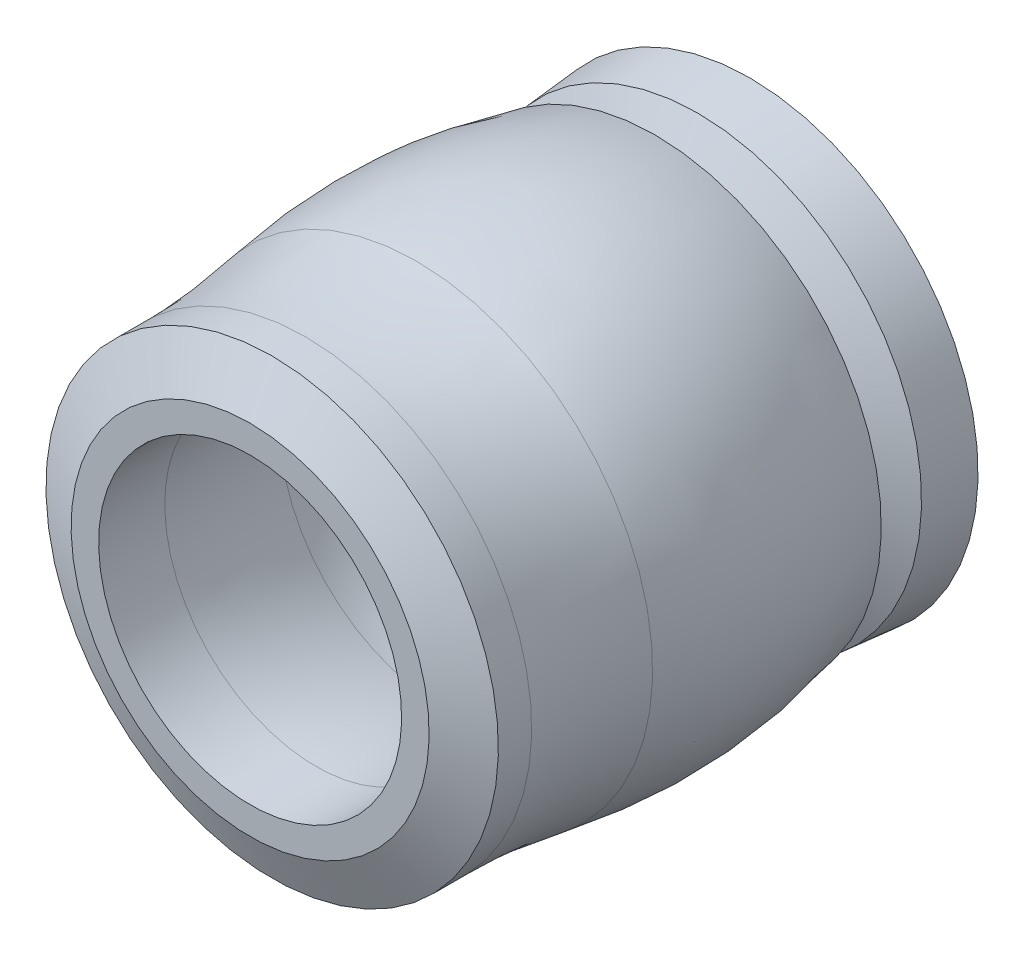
ISO-10303-21;
HEADER;
FILE_DESCRIPTION(('STEP AP214'),'2;1');
FILE_NAME('part.step','',(''),(''),'','','');
FILE_SCHEMA(('AUTOMOTIVE_DESIGN { 1 0 10303 214 1 1 1 1 }'));
ENDSEC;
DATA;
#1=APPLICATION_CONTEXT('core data for automotive mechanical design processes');
#2=APPLICATION_PROTOCOL_DEFINITION('international standard','automotive_design',2000,#1);
#3=PRODUCT_CONTEXT('',#1,'mechanical');
#4=PRODUCT('Part','Part','',(#3));
#5=PRODUCT_RELATED_PRODUCT_CATEGORY('part','',(#4));
#6=PRODUCT_DEFINITION_FORMATION('','',#4);
#7=PRODUCT_DEFINITION_CONTEXT('part definition',#1,'design');
#8=PRODUCT_DEFINITION('design','',#6,#7);
#9=PRODUCT_DEFINITION_SHAPE('','',#8);
#10=(LENGTH_UNIT() NAMED_UNIT(*) SI_UNIT(.MILLI.,.METRE.));
#11=(NAMED_UNIT(*) PLANE_ANGLE_UNIT() SI_UNIT($,.RADIAN.));
#12=(NAMED_UNIT(*) SI_UNIT($,.STERADIAN.) SOLID_ANGLE_UNIT());
#13=UNCERTAINTY_MEASURE_WITH_UNIT(LENGTH_MEASURE(1.E-05),#10,'distance_accuracy_value','');
#14=(GEOMETRIC_REPRESENTATION_CONTEXT(3) GLOBAL_UNCERTAINTY_ASSIGNED_CONTEXT((#13)) GLOBAL_UNIT_ASSIGNED_CONTEXT((#10,
#11,#12)) REPRESENTATION_CONTEXT('',''));
#15=CARTESIAN_POINT('',(0.,0.,0.));
#16=DIRECTION('',(0.,0.,1.));
#17=DIRECTION('',(1.,0.,0.));
#18=AXIS2_PLACEMENT_3D('',#15,#16,#17);
#19=CARTESIAN_POINT('',(0.,0.,7.28448644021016));
#20=DIRECTION('',(0.,0.,-1.));
#21=DIRECTION('',(0.,1.,0.));
#22=AXIS2_PLACEMENT_3D('',#19,#20,#21);
#23=TOROIDAL_SURFACE('',#22,12.065,2.286);
#24=CARTESIAN_POINT('',(0.,0.,7.28448644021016));
#25=DIRECTION('',(0.,0.,-1.));
#26=DIRECTION('',(0.,1.,0.));
#27=AXIS2_PLACEMENT_3D('',#24,#25,#26);
#28=CIRCLE('',#27,9.779);
#29=CARTESIAN_POINT('',(0.,9.779,7.28448644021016));
#30=VERTEX_POINT('',#29);
#31=EDGE_CURVE('E97',#30,#30,#28,.T.);
#32=ORIENTED_EDGE('',*,*,#31,.T.);
#33=EDGE_LOOP('',(#32));
#34=FACE_BOUND('',#33,.T.);
#35=CARTESIAN_POINT('',(0.,0.,7.92807854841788));
#36=DIRECTION('',(0.,0.,-1.));
#37=DIRECTION('',(0.,1.,0.));
#38=AXIS2_PLACEMENT_3D('',#35,#36,#37);
#39=CIRCLE('',#38,9.87146741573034);
#40=CARTESIAN_POINT('',(0.,9.87146741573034,7.92807854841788));
#41=VERTEX_POINT('',#40);
#42=EDGE_CURVE('E153',#41,#41,#39,.F.);
#43=ORIENTED_EDGE('',*,*,#42,.T.);
#44=EDGE_LOOP('',(#43));
#45=FACE_BOUND('',#44,.T.);
#46=ADVANCED_FACE('F12',(#34,#45),#23,.T.);
#47=CARTESIAN_POINT('',(0.,-15.0495,15.24));
#48=DIRECTION('',(1.,0.,0.));
#49=DIRECTION('',(0.,1.,0.));
#50=AXIS2_PLACEMENT_3D('',#47,#48,#49);
#51=CIRCLE('',#50,25.9715);
#52=TRIMMED_CURVE('',#51,(PARAMETER_VALUE(-0.952727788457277)),
(PARAMETER_VALUE(0.952727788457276)),.T.,.PARAMETER.);
#53=CARTESIAN_POINT('',(0.,0.,15.24));
#54=DIRECTION('',(0.,0.,-1.));
#55=AXIS1_PLACEMENT('',#53,#54);
#56=SURFACE_OF_REVOLUTION('',#52,#55);
#57=ORIENTED_EDGE('',*,*,#42,.F.);
#58=EDGE_LOOP('',(#57));
#59=FACE_BOUND('',#58,.T.);
#60=CARTESIAN_POINT('',(0.,0.,19.859163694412));
#61=DIRECTION('',(0.,0.,-1.));
#62=DIRECTION('',(0.,1.,0.));
#63=AXIS2_PLACEMENT_3D('',#60,#61,#62);
#64=CIRCLE('',#63,10.507928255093);
#65=CARTESIAN_POINT('',(0.,10.507928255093,19.859163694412));
#66=VERTEX_POINT('',#65);
#67=EDGE_CURVE('E94',#66,#66,#64,.T.);
#68=ORIENTED_EDGE('',*,*,#67,.F.);
#69=EDGE_LOOP('',(#68));
#70=FACE_BOUND('',#69,.T.);
#71=ADVANCED_FACE('F101',(#59,#70),#56,.T.);
#72=CARTESIAN_POINT('',(0.,0.,-7.51702702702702));
#73=DIRECTION('',(0.,0.,-1.));
#74=DIRECTION('',(0.,1.,0.));
#75=AXIS2_PLACEMENT_3D('',#72,#73,#74);
#76=CYLINDRICAL_SURFACE('',#75,9.779);
#77=CARTESIAN_POINT('',(0.,0.,7.18288027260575));
#78=DIRECTION('',(0.,0.,1.));
#79=DIRECTION('',(0.,-1.,0.));
#80=AXIS2_PLACEMENT_3D('',#77,#78,#79);
#81=CIRCLE('',#80,9.779);
#82=CARTESIAN_POINT('',(0.,-9.779,7.18288027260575));
#83=VERTEX_POINT('',#82);
#84=EDGE_CURVE('E91',#83,#83,#81,.F.);
#85=ORIENTED_EDGE('',*,*,#84,.T.);
#86=EDGE_LOOP('',(#85));
#87=FACE_BOUND('',#86,.T.);
#88=ORIENTED_EDGE('',*,*,#31,.F.);
#89=EDGE_LOOP('',(#88));
#90=FACE_BOUND('',#89,.T.);
#91=ADVANCED_FACE('F84',(#87,#90),#76,.F.);
#92=CARTESIAN_POINT('',(0.,0.,27.9906988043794));
#93=DIRECTION('',(0.,0.,-1.));
#94=DIRECTION('',(0.,1.,0.));
#95=AXIS2_PLACEMENT_3D('',#92,#93,#94);
#96=TOROIDAL_SURFACE('',#95,55.499,45.72);
#97=ORIENTED_EDGE('',*,*,#67,.T.);
#98=EDGE_LOOP('',(#97));
#99=FACE_BOUND('',#98,.T.);
#100=CARTESIAN_POINT('',(0.,0.,27.9906988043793));
#101=DIRECTION('',(0.,0.,-1.));
#102=DIRECTION('',(0.,1.,0.));
#103=AXIS2_PLACEMENT_3D('',#100,#101,#102);
#104=CIRCLE('',#103,9.779);
#105=CARTESIAN_POINT('',(0.,9.779,27.9906988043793));
#106=VERTEX_POINT('',#105);
#107=EDGE_CURVE('E89',#106,#106,#104,.F.);
#108=ORIENTED_EDGE('',*,*,#107,.T.);
#109=EDGE_LOOP('',(#108));
#110=FACE_BOUND('',#109,.T.);
#111=ADVANCED_FACE('F79',(#99,#110),#96,.T.);
#112=CARTESIAN_POINT('',(0.,0.,7.18288027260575));
#113=DIRECTION('',(0.,0.,1.));
#114=DIRECTION('',(-1.,0.,0.));
#115=AXIS2_PLACEMENT_3D('',#112,#113,#114);
#116=CONICAL_SURFACE('',#115,9.779,1.0471975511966);
#117=ORIENTED_EDGE('',*,*,#84,.F.);
#118=EDGE_LOOP('',(#117));
#119=FACE_BOUND('',#118,.T.);
#120=CARTESIAN_POINT('',(0.,0.,3.81));
#121=DIRECTION('',(0.,0.,-1.));
#122=DIRECTION('',(0.,1.,0.));
#123=AXIS2_PLACEMENT_3D('',#120,#121,#122);
#124=CIRCLE('',#123,3.937);
#125=CARTESIAN_POINT('',(0.,3.937,3.81));
#126=VERTEX_POINT('',#125);
#127=EDGE_CURVE('E133',#126,#126,#124,.T.);
#128=ORIENTED_EDGE('',*,*,#127,.T.);
#129=EDGE_LOOP('',(#128));
#130=FACE_BOUND('',#129,.T.);
#131=ADVANCED_FACE('F75',(#119,#130),#116,.F.);
#132=CARTESIAN_POINT('',(0.,0.,-7.51702702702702));
#133=DIRECTION('',(0.,0.,-1.));
#134=DIRECTION('',(0.,1.,0.));
#135=AXIS2_PLACEMENT_3D('',#132,#133,#134);
#136=CYLINDRICAL_SURFACE('',#135,9.779);
#137=ORIENTED_EDGE('',*,*,#107,.F.);
#138=EDGE_LOOP('',(#137));
#139=FACE_BOUND('',#138,.T.);
#140=CARTESIAN_POINT('',(0.,0.,32.258));
#141=DIRECTION('',(0.,0.,-1.));
#142=DIRECTION('',(0.,1.,0.));
#143=AXIS2_PLACEMENT_3D('',#140,#141,#142);
#144=CIRCLE('',#143,9.779);
#145=CARTESIAN_POINT('',(0.,9.779,32.258));
#146=VERTEX_POINT('',#145);
#147=EDGE_CURVE('E16',#146,#146,#144,.T.);
#148=ORIENTED_EDGE('',*,*,#147,.F.);
#149=EDGE_LOOP('',(#148));
#150=FACE_BOUND('',#149,.T.);
#151=ADVANCED_FACE('F71',(#139,#150),#136,.F.);
#152=CARTESIAN_POINT('',(0.,0.,-7.51702702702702));
#153=DIRECTION('',(0.,0.,-1.));
#154=DIRECTION('',(0.,1.,0.));
#155=AXIS2_PLACEMENT_3D('',#152,#153,#154);
#156=CYLINDRICAL_SURFACE('',#155,3.937);
#157=CARTESIAN_POINT('',(0.,0.,0.));
#158=DIRECTION('',(0.,0.,-1.));
#159=DIRECTION('',(0.,1.,0.));
#160=AXIS2_PLACEMENT_3D('',#157,#158,#159);
#161=CIRCLE('',#160,3.937);
#162=CARTESIAN_POINT('',(0.,3.937,0.));
#163=VERTEX_POINT('',#162);
#164=EDGE_CURVE('E138',#163,#163,#161,.F.);
#165=ORIENTED_EDGE('',*,*,#164,.F.);
#166=EDGE_LOOP('',(#165));
#167=FACE_BOUND('',#166,.T.);
#168=ORIENTED_EDGE('',*,*,#127,.F.);
#169=EDGE_LOOP('',(#168));
#170=FACE_BOUND('',#169,.T.);
#171=ADVANCED_FACE('F67',(#167,#170),#156,.F.);
#172=CARTESIAN_POINT('',(11.557,0.,32.258));
#173=DIRECTION('',(0.,0.,1.));
#174=DIRECTION('',(0.,-1.,0.));
#175=AXIS2_PLACEMENT_3D('',#172,#173,#174);
#176=PLANE('',#175);
#177=CARTESIAN_POINT('',(0.,0.,32.258));
#178=DIRECTION('',(0.,0.,-1.));
#179=DIRECTION('',(0.,1.,0.));
#180=AXIS2_PLACEMENT_3D('',#177,#178,#179);
#181=CIRCLE('',#180,11.557);
#182=CARTESIAN_POINT('',(0.,11.557,32.258));
#183=VERTEX_POINT('',#182);
#184=EDGE_CURVE('E146',#183,#183,#181,.T.);
#185=ORIENTED_EDGE('',*,*,#184,.F.);
#186=EDGE_LOOP('',(#185));
#187=FACE_BOUND('',#186,.T.);
#188=ORIENTED_EDGE('',*,*,#147,.T.);
#189=EDGE_LOOP('',(#188));
#190=FACE_BOUND('',#189,.T.);
#191=ADVANCED_FACE('F63',(#187,#190),#176,.T.);
#192=CARTESIAN_POINT('',(3.937,0.,0.));
#193=DIRECTION('',(0.,0.,-1.));
#194=DIRECTION('',(0.,1.,0.));
#195=AXIS2_PLACEMENT_3D('',#192,#193,#194);
#196=PLANE('',#195);
#197=ORIENTED_EDGE('',*,*,#164,.T.);
#198=EDGE_LOOP('',(#197));
#199=FACE_BOUND('',#198,.T.);
#200=CARTESIAN_POINT('',(0.,0.,0.));
#201=DIRECTION('',(0.,0.,-1.));
#202=DIRECTION('',(0.,1.,0.));
#203=AXIS2_PLACEMENT_3D('',#200,#201,#202);
#204=CIRCLE('',#203,14.732);
#205=CARTESIAN_POINT('',(0.,14.732,0.));
#206=VERTEX_POINT('',#205);
#207=EDGE_CURVE('E132',#206,#206,#204,.F.);
#208=ORIENTED_EDGE('',*,*,#207,.F.);
#209=EDGE_LOOP('',(#208));
#210=FACE_BOUND('',#209,.T.);
#211=ADVANCED_FACE('F59',(#199,#210),#196,.T.);
#212=CARTESIAN_POINT('',(0.,0.,30.8366942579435));
#213=DIRECTION('',(0.,0.,-1.));
#214=DIRECTION('',(0.,1.,0.));
#215=AXIS2_PLACEMENT_3D('',#212,#213,#214);
#216=CONICAL_SURFACE('',#215,14.605,1.13446401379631);
#217=CARTESIAN_POINT('',(0.,0.,30.8366942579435));
#218=DIRECTION('',(0.,0.,-1.));
#219=DIRECTION('',(0.,1.,0.));
#220=AXIS2_PLACEMENT_3D('',#217,#218,#219);
#221=CIRCLE('',#220,14.605);
#222=CARTESIAN_POINT('',(0.,14.605,30.8366942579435));
#223=VERTEX_POINT('',#222);
#224=EDGE_CURVE('E128',#223,#223,#221,.T.);
#225=ORIENTED_EDGE('',*,*,#224,.F.);
#226=EDGE_LOOP('',(#225));
#227=FACE_BOUND('',#226,.T.);
#228=ORIENTED_EDGE('',*,*,#184,.T.);
#229=EDGE_LOOP('',(#228));
#230=FACE_BOUND('',#229,.T.);
#231=ADVANCED_FACE('F55',(#227,#230),#216,.T.);
#232=CARTESIAN_POINT('',(0.,0.,0.));
#233=DIRECTION('',(0.,0.,-1.));
#234=DIRECTION('',(0.,1.,0.));
#235=AXIS2_PLACEMENT_3D('',#232,#233,#234);
#236=CONICAL_SURFACE('',#235,14.732,0.0872664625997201);
#237=ORIENTED_EDGE('',*,*,#207,.T.);
#238=EDGE_LOOP('',(#237));
#239=FACE_BOUND('',#238,.T.);
#240=CARTESIAN_POINT('',(0.,0.,3.35536060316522));
#241=DIRECTION('',(0.,0.,-1.));
#242=DIRECTION('',(0.,1.,0.));
#243=AXIS2_PLACEMENT_3D('',#240,#241,#242);
#244=CIRCLE('',#243,14.4384439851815);
#245=CARTESIAN_POINT('',(0.,14.4384439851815,3.35536060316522));
#246=VERTEX_POINT('',#245);
#247=EDGE_CURVE('E126',#246,#246,#244,.F.);
#248=ORIENTED_EDGE('',*,*,#247,.F.);
#249=EDGE_LOOP('',(#248));
#250=FACE_BOUND('',#249,.T.);
#251=ADVANCED_FACE('F51',(#239,#250),#236,.T.);
#252=CARTESIAN_POINT('',(0.,0.,-7.51702702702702));
#253=DIRECTION('',(0.,0.,-1.));
#254=DIRECTION('',(0.,1.,0.));
#255=AXIS2_PLACEMENT_3D('',#252,#253,#254);
#256=CYLINDRICAL_SURFACE('',#255,14.605);
#257=CARTESIAN_POINT('',(0.,0.,28.6869066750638));
#258=DIRECTION('',(0.,0.,-1.));
#259=DIRECTION('',(0.,1.,0.));
#260=AXIS2_PLACEMENT_3D('',#257,#258,#259);
#261=CIRCLE('',#260,14.605);
#262=CARTESIAN_POINT('',(0.,14.605,28.6869066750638));
#263=VERTEX_POINT('',#262);
#264=EDGE_CURVE('E32',#263,#263,#261,.F.);
#265=ORIENTED_EDGE('',*,*,#264,.T.);
#266=EDGE_LOOP('',(#265));
#267=FACE_BOUND('',#266,.T.);
#268=ORIENTED_EDGE('',*,*,#224,.T.);
#269=EDGE_LOOP('',(#268));
#270=FACE_BOUND('',#269,.T.);
#271=ADVANCED_FACE('F47',(#267,#270),#256,.T.);
#272=CARTESIAN_POINT('',(0.,0.,3.35536060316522));
#273=DIRECTION('',(0.,0.,-1.));
#274=DIRECTION('',(0.,1.,0.));
#275=AXIS2_PLACEMENT_3D('',#272,#273,#274);
#276=CONICAL_SURFACE('',#275,14.4384439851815,1.13446401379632);
#277=ORIENTED_EDGE('',*,*,#247,.T.);
#278=EDGE_LOOP('',(#277));
#279=FACE_BOUND('',#278,.T.);
#280=CARTESIAN_POINT('',(0.,0.,4.699));
#281=DIRECTION('',(0.,0.,1.));
#282=DIRECTION('',(0.,-1.,0.));
#283=AXIS2_PLACEMENT_3D('',#280,#281,#282);
#284=CIRCLE('',#283,11.557);
#285=CARTESIAN_POINT('',(0.,-11.557,4.699));
#286=VERTEX_POINT('',#285);
#287=EDGE_CURVE('E25',#286,#286,#284,.T.);
#288=ORIENTED_EDGE('',*,*,#287,.F.);
#289=EDGE_LOOP('',(#288));
#290=FACE_BOUND('',#289,.T.);
#291=ADVANCED_FACE('F42',(#279,#290),#276,.T.);
#292=CARTESIAN_POINT('',(0.,0.,28.6869066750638));
#293=DIRECTION('',(0.,0.,-1.));
#294=DIRECTION('',(0.,1.,0.));
#295=AXIS2_PLACEMENT_3D('',#292,#293,#294);
#296=TOROIDAL_SURFACE('',#295,55.245,40.64);
#297=CARTESIAN_POINT('',(0.,0.,21.5159390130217));
#298=DIRECTION('',(0.,0.,-1.));
#299=DIRECTION('',(0.,1.,0.));
#300=AXIS2_PLACEMENT_3D('',#297,#298,#299);
#301=CIRCLE('',#300,15.2426647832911);
#302=CARTESIAN_POINT('',(0.,15.2426647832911,21.5159390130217));
#303=VERTEX_POINT('',#302);
#304=EDGE_CURVE('E20',#303,#303,#301,.T.);
#305=ORIENTED_EDGE('',*,*,#304,.F.);
#306=EDGE_LOOP('',(#305));
#307=FACE_BOUND('',#306,.T.);
#308=ORIENTED_EDGE('',*,*,#264,.F.);
#309=EDGE_LOOP('',(#308));
#310=FACE_BOUND('',#309,.T.);
#311=ADVANCED_FACE('F37',(#307,#310),#296,.F.);
#312=CARTESIAN_POINT('',(0.,0.,6.12030574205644));
#313=DIRECTION('',(0.,0.,1.));
#314=DIRECTION('',(0.,-1.,0.));
#315=AXIS2_PLACEMENT_3D('',#312,#313,#314);
#316=CONICAL_SURFACE('',#315,14.605,1.13446401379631);
#317=CARTESIAN_POINT('',(0.,0.,6.12030574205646));
#318=DIRECTION('',(0.,0.,-1.));
#319=DIRECTION('',(0.,1.,0.));
#320=AXIS2_PLACEMENT_3D('',#317,#318,#319);
#321=CIRCLE('',#320,14.605);
#322=CARTESIAN_POINT('',(0.,14.605,6.12030574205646));
#323=VERTEX_POINT('',#322);
#324=EDGE_CURVE('E8',#323,#323,#321,.F.);
#325=ORIENTED_EDGE('',*,*,#324,.F.);
#326=EDGE_LOOP('',(#325));
#327=FACE_BOUND('',#326,.T.);
#328=ORIENTED_EDGE('',*,*,#287,.T.);
#329=EDGE_LOOP('',(#328));
#330=FACE_BOUND('',#329,.T.);
#331=ADVANCED_FACE('F41',(#327,#330),#316,.T.);
#332=CARTESIAN_POINT('',(0.,-19.6990731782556,15.2521528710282));
#333=DIRECTION('',(1.,0.,0.));
#334=DIRECTION('',(0.,1.,0.));
#335=AXIS2_PLACEMENT_3D('',#332,#333,#334);
#336=CIRCLE('',#335,35.4987333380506);
#337=TRIMMED_CURVE('',#336,(PARAMETER_VALUE(-0.982525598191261)),
(PARAMETER_VALUE(0.982525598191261)),.T.,.PARAMETER.);
#338=CARTESIAN_POINT('',(0.,0.,15.2521528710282));
#339=DIRECTION('',(0.,0.,-1.));
#340=AXIS1_PLACEMENT('',#338,#339);
#341=SURFACE_OF_REVOLUTION('',#337,#340);
#342=ORIENTED_EDGE('',*,*,#324,.T.);
#343=EDGE_LOOP('',(#342));
#344=FACE_BOUND('',#343,.T.);
#345=ORIENTED_EDGE('',*,*,#304,.T.);
#346=EDGE_LOOP('',(#345));
#347=FACE_BOUND('',#346,.T.);
#348=ADVANCED_FACE('F114',(#344,#347),#341,.F.);
#349=CLOSED_SHELL('',(#46,#71,#91,#111,#131,#151,#171,#191,#211,#231,#251,#271,#291,#311,#331,#348));
#350=MANIFOLD_SOLID_BREP('B1',#349);
#351=ADVANCED_BREP_SHAPE_REPRESENTATION('',(#18,#350),#14);
#352=SHAPE_DEFINITION_REPRESENTATION(#9,#351);
ENDSEC;
END-ISO-10303-21;
